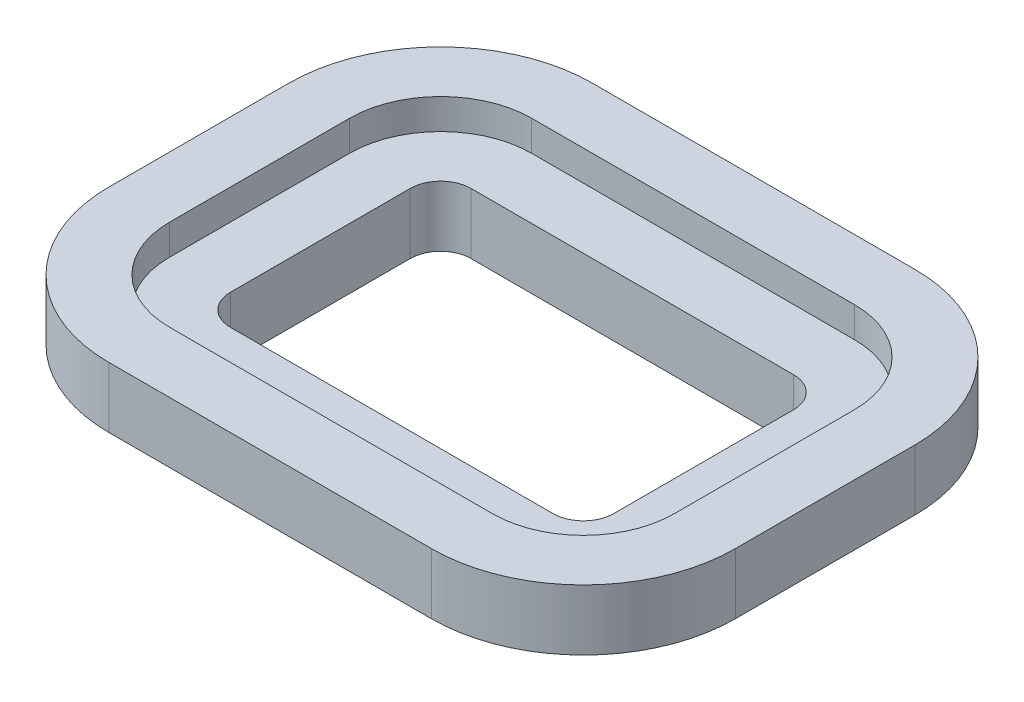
ISO-10303-21;
HEADER;
FILE_DESCRIPTION(('STEP AP214'),'2;1');
FILE_NAME('part.step','',(''),(''),'','','');
FILE_SCHEMA(('AUTOMOTIVE_DESIGN { 1 0 10303 214 1 1 1 1 }'));
ENDSEC;
DATA;
#1=APPLICATION_CONTEXT('core data for automotive mechanical design processes');
#2=APPLICATION_PROTOCOL_DEFINITION('international standard','automotive_design',2000,#1);
#3=PRODUCT_CONTEXT('',#1,'mechanical');
#4=PRODUCT('Part','Part','',(#3));
#5=PRODUCT_RELATED_PRODUCT_CATEGORY('part','',(#4));
#6=PRODUCT_DEFINITION_FORMATION('','',#4);
#7=PRODUCT_DEFINITION_CONTEXT('part definition',#1,'design');
#8=PRODUCT_DEFINITION('design','',#6,#7);
#9=PRODUCT_DEFINITION_SHAPE('','',#8);
#10=(LENGTH_UNIT() NAMED_UNIT(*) SI_UNIT(.MILLI.,.METRE.));
#11=(NAMED_UNIT(*) PLANE_ANGLE_UNIT() SI_UNIT($,.RADIAN.));
#12=(NAMED_UNIT(*) SI_UNIT($,.STERADIAN.) SOLID_ANGLE_UNIT());
#13=UNCERTAINTY_MEASURE_WITH_UNIT(LENGTH_MEASURE(1.E-05),#10,'distance_accuracy_value','');
#14=(GEOMETRIC_REPRESENTATION_CONTEXT(3) GLOBAL_UNCERTAINTY_ASSIGNED_CONTEXT((#13)) GLOBAL_UNIT_ASSIGNED_CONTEXT((#10,
#11,#12)) REPRESENTATION_CONTEXT('',''));
#15=CARTESIAN_POINT('',(0.,0.,0.));
#16=DIRECTION('',(0.,0.,1.));
#17=DIRECTION('',(1.,0.,0.));
#18=AXIS2_PLACEMENT_3D('',#15,#16,#17);
#19=CARTESIAN_POINT('',(116.208722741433,0.,-10.));
#20=DIRECTION('',(0.,-1.,0.));
#21=DIRECTION('',(0.,0.,-1.));
#22=AXIS2_PLACEMENT_3D('',#19,#20,#21);
#23=CYLINDRICAL_SURFACE('',#22,9.99999999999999);
#24=DIRECTION('',(0.,1.,0.));
#25=VECTOR('',#24,1.);
#26=CARTESIAN_POINT('',(126.208722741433,0.,-10.0000000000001));
#27=LINE('',#26,#25);
#28=CARTESIAN_POINT('',(126.208722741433,-20.,-10.0000000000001));
#29=VERTEX_POINT('',#28);
#30=CARTESIAN_POINT('',(126.208722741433,0.,-10.0000000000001));
#31=VERTEX_POINT('',#30);
#32=EDGE_CURVE('E350',#29,#31,#27,.T.);
#33=ORIENTED_EDGE('',*,*,#32,.F.);
#34=CARTESIAN_POINT('',(116.208722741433,-20.,-10.));
#35=DIRECTION('',(0.,-1.,0.));
#36=DIRECTION('',(0.,0.,-1.));
#37=AXIS2_PLACEMENT_3D('',#34,#35,#36);
#38=CIRCLE('',#37,9.99999999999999);
#39=CARTESIAN_POINT('',(116.208722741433,-20.,0.));
#40=VERTEX_POINT('',#39);
#41=EDGE_CURVE('E44',#29,#40,#38,.T.);
#42=ORIENTED_EDGE('',*,*,#41,.T.);
#43=CARTESIAN_POINT('',(116.208722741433,-20.,0.));
#44=DIRECTION('',(0.,1.,0.));
#45=VECTOR('',#44,1.);
#46=LINE('',#43,#45);
#47=CARTESIAN_POINT('',(116.208722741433,0.,0.));
#48=VERTEX_POINT('',#47);
#49=EDGE_CURVE('E279',#40,#48,#46,.T.);
#50=ORIENTED_EDGE('',*,*,#49,.T.);
#51=CARTESIAN_POINT('',(116.208722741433,0.,-10.));
#52=DIRECTION('',(0.,-1.,0.));
#53=DIRECTION('',(0.,0.,-1.));
#54=AXIS2_PLACEMENT_3D('',#51,#52,#53);
#55=CIRCLE('',#54,9.99999999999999);
#56=EDGE_CURVE('E11',#31,#48,#55,.T.);
#57=ORIENTED_EDGE('',*,*,#56,.F.);
#58=EDGE_LOOP('',(#33,#42,#50,#57));
#59=FACE_BOUND('',#58,.T.);
#60=ADVANCED_FACE('F33',(#59),#23,.F.);
#61=CARTESIAN_POINT('',(116.208722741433,0.,-10.));
#62=DIRECTION('',(0.,-1.,0.));
#63=DIRECTION('',(0.,0.,-1.));
#64=AXIS2_PLACEMENT_3D('',#61,#62,#63);
#65=CYLINDRICAL_SURFACE('',#64,30.);
#66=DIRECTION('',(0.,-1.,0.));
#67=VECTOR('',#66,1.);
#68=CARTESIAN_POINT('',(146.208722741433,-20.,-9.99999999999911));
#69=LINE('',#68,#67);
#70=CARTESIAN_POINT('',(146.208722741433,-10.,-9.99999999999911));
#71=VERTEX_POINT('',#70);
#72=CARTESIAN_POINT('',(146.208722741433,-20.,-9.99999999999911));
#73=VERTEX_POINT('',#72);
#74=EDGE_CURVE('E346',#71,#73,#69,.T.);
#75=ORIENTED_EDGE('',*,*,#74,.F.);
#76=CARTESIAN_POINT('',(116.208722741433,-10.,-10.));
#77=DIRECTION('',(0.,-1.,0.));
#78=DIRECTION('',(0.,0.,-1.));
#79=AXIS2_PLACEMENT_3D('',#76,#77,#78);
#80=CIRCLE('',#79,30.);
#81=CARTESIAN_POINT('',(116.208722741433,-10.,20.));
#82=VERTEX_POINT('',#81);
#83=EDGE_CURVE('E314',#71,#82,#80,.T.);
#84=ORIENTED_EDGE('',*,*,#83,.T.);
#85=CARTESIAN_POINT('',(116.208722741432,-10.,20.));
#86=DIRECTION('',(0.,-1.,0.));
#87=VECTOR('',#86,1.);
#88=LINE('',#85,#87);
#89=CARTESIAN_POINT('',(116.208722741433,-20.,20.));
#90=VERTEX_POINT('',#89);
#91=EDGE_CURVE('E404',#82,#90,#88,.T.);
#92=ORIENTED_EDGE('',*,*,#91,.T.);
#93=CARTESIAN_POINT('',(116.208722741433,-20.,-10.));
#94=DIRECTION('',(0.,-1.,0.));
#95=DIRECTION('',(0.,0.,-1.));
#96=AXIS2_PLACEMENT_3D('',#93,#94,#95);
#97=CIRCLE('',#96,30.);
#98=EDGE_CURVE('E322',#73,#90,#97,.T.);
#99=ORIENTED_EDGE('',*,*,#98,.F.);
#100=EDGE_LOOP('',(#75,#84,#92,#99));
#101=FACE_BOUND('',#100,.T.);
#102=ADVANCED_FACE('F300',(#101),#65,.T.);
#103=CARTESIAN_POINT('',(116.208722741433,0.,-10.));
#104=DIRECTION('',(0.,-1.,0.));
#105=DIRECTION('',(0.,0.,-1.));
#106=AXIS2_PLACEMENT_3D('',#103,#104,#105);
#107=CYLINDRICAL_SURFACE('',#106,50.);
#108=DIRECTION('',(0.,-1.,0.));
#109=VECTOR('',#108,1.);
#110=CARTESIAN_POINT('',(166.208722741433,-10.,-9.99999999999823));
#111=LINE('',#110,#109);
#112=CARTESIAN_POINT('',(166.208722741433,10.,-9.99999999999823));
#113=VERTEX_POINT('',#112);
#114=CARTESIAN_POINT('',(166.208722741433,-10.,-9.99999999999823));
#115=VERTEX_POINT('',#114);
#116=EDGE_CURVE('E338',#113,#115,#111,.T.);
#117=ORIENTED_EDGE('',*,*,#116,.F.);
#118=CARTESIAN_POINT('',(116.208722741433,10.,-10.));
#119=DIRECTION('',(0.,-1.,0.));
#120=DIRECTION('',(0.,0.,-1.));
#121=AXIS2_PLACEMENT_3D('',#118,#119,#120);
#122=CIRCLE('',#121,50.);
#123=CARTESIAN_POINT('',(116.208722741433,10.,40.));
#124=VERTEX_POINT('',#123);
#125=EDGE_CURVE('E274',#113,#124,#122,.T.);
#126=ORIENTED_EDGE('',*,*,#125,.T.);
#127=CARTESIAN_POINT('',(116.208722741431,10.,40.));
#128=DIRECTION('',(0.,-1.,0.));
#129=VECTOR('',#128,1.);
#130=LINE('',#127,#129);
#131=CARTESIAN_POINT('',(116.208722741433,-10.,40.));
#132=VERTEX_POINT('',#131);
#133=EDGE_CURVE('E266',#124,#132,#130,.T.);
#134=ORIENTED_EDGE('',*,*,#133,.T.);
#135=CARTESIAN_POINT('',(116.208722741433,-10.,-10.));
#136=DIRECTION('',(0.,-1.,0.));
#137=DIRECTION('',(0.,0.,-1.));
#138=AXIS2_PLACEMENT_3D('',#135,#136,#137);
#139=CIRCLE('',#138,50.);
#140=EDGE_CURVE('E277',#115,#132,#139,.T.);
#141=ORIENTED_EDGE('',*,*,#140,.F.);
#142=EDGE_LOOP('',(#117,#126,#134,#141));
#143=FACE_BOUND('',#142,.T.);
#144=ADVANCED_FACE('F291',(#143),#107,.T.);
#145=CARTESIAN_POINT('',(116.208722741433,0.,-10.));
#146=DIRECTION('',(0.,-1.,0.));
#147=DIRECTION('',(0.,0.,-1.));
#148=AXIS2_PLACEMENT_3D('',#145,#146,#147);
#149=CYLINDRICAL_SURFACE('',#148,30.);
#150=DIRECTION('',(0.,1.,0.));
#151=VECTOR('',#150,1.);
#152=CARTESIAN_POINT('',(146.208722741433,10.,-9.99999999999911));
#153=LINE('',#152,#151);
#154=CARTESIAN_POINT('',(146.208722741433,0.,-9.99999999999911));
#155=VERTEX_POINT('',#154);
#156=CARTESIAN_POINT('',(146.208722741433,10.,-9.99999999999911));
#157=VERTEX_POINT('',#156);
#158=EDGE_CURVE('E347',#155,#157,#153,.T.);
#159=ORIENTED_EDGE('',*,*,#158,.F.);
#160=CARTESIAN_POINT('',(116.208722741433,0.,-10.));
#161=DIRECTION('',(0.,-1.,0.));
#162=DIRECTION('',(0.,0.,-1.));
#163=AXIS2_PLACEMENT_3D('',#160,#161,#162);
#164=CIRCLE('',#163,30.);
#165=CARTESIAN_POINT('',(116.208722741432,0.,20.));
#166=VERTEX_POINT('',#165);
#167=EDGE_CURVE('E60',#155,#166,#164,.T.);
#168=ORIENTED_EDGE('',*,*,#167,.T.);
#169=CARTESIAN_POINT('',(116.208722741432,0.,20.));
#170=DIRECTION('',(0.,1.,0.));
#171=VECTOR('',#170,1.);
#172=LINE('',#169,#171);
#173=CARTESIAN_POINT('',(116.208722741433,10.,20.));
#174=VERTEX_POINT('',#173);
#175=EDGE_CURVE('E253',#166,#174,#172,.T.);
#176=ORIENTED_EDGE('',*,*,#175,.T.);
#177=CARTESIAN_POINT('',(116.208722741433,10.,-10.));
#178=DIRECTION('',(0.,-1.,0.));
#179=DIRECTION('',(0.,0.,-1.));
#180=AXIS2_PLACEMENT_3D('',#177,#178,#179);
#181=CIRCLE('',#180,30.);
#182=EDGE_CURVE('E264',#157,#174,#181,.T.);
#183=ORIENTED_EDGE('',*,*,#182,.F.);
#184=EDGE_LOOP('',(#159,#168,#176,#183));
#185=FACE_BOUND('',#184,.T.);
#186=ADVANCED_FACE('F263',(#185),#149,.F.);
#187=CARTESIAN_POINT('',(126.208722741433,0.,-69.2068535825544));
#188=DIRECTION('',(1.,0.,0.));
#189=DIRECTION('',(0.,1.,0.));
#190=AXIS2_PLACEMENT_3D('',#187,#188,#189);
#191=PLANE('',#190);
#192=DIRECTION('',(0.,1.,0.));
#193=VECTOR('',#192,1.);
#194=CARTESIAN_POINT('',(126.208722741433,0.,-69.2068535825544));
#195=LINE('',#194,#193);
#196=CARTESIAN_POINT('',(126.208722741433,-20.,-69.2068535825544));
#197=VERTEX_POINT('',#196);
#198=CARTESIAN_POINT('',(126.208722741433,0.,-69.2068535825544));
#199=VERTEX_POINT('',#198);
#200=EDGE_CURVE('E623',#197,#199,#195,.T.);
#201=ORIENTED_EDGE('',*,*,#200,.F.);
#202=DIRECTION('',(0.,0.,1.));
#203=VECTOR('',#202,1.);
#204=CARTESIAN_POINT('',(126.208722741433,-20.,-69.2068535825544));
#205=LINE('',#204,#203);
#206=EDGE_CURVE('E370',#197,#29,#205,.T.);
#207=ORIENTED_EDGE('',*,*,#206,.T.);
#208=ORIENTED_EDGE('',*,*,#32,.T.);
#209=DIRECTION('',(0.,0.,1.));
#210=VECTOR('',#209,1.);
#211=CARTESIAN_POINT('',(126.208722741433,0.,-69.2068535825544));
#212=LINE('',#211,#210);
#213=EDGE_CURVE('E267',#199,#31,#212,.T.);
#214=ORIENTED_EDGE('',*,*,#213,.F.);
#215=EDGE_LOOP('',(#201,#207,#208,#214));
#216=FACE_BOUND('',#215,.T.);
#217=ADVANCED_FACE('F655',(#216),#191,.F.);
#218=CARTESIAN_POINT('',(146.208722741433,-20.,-69.2068535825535));
#219=DIRECTION('',(-1.,0.,0.));
#220=DIRECTION('',(0.,0.,1.));
#221=AXIS2_PLACEMENT_3D('',#218,#219,#220);
#222=PLANE('',#221);
#223=DIRECTION('',(0.,-1.,0.));
#224=VECTOR('',#223,1.);
#225=CARTESIAN_POINT('',(146.208722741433,-20.,-69.2068535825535));
#226=LINE('',#225,#224);
#227=CARTESIAN_POINT('',(146.208722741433,-10.,-69.2068535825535));
#228=VERTEX_POINT('',#227);
#229=CARTESIAN_POINT('',(146.208722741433,-20.,-69.2068535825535));
#230=VERTEX_POINT('',#229);
#231=EDGE_CURVE('E409',#228,#230,#226,.T.);
#232=ORIENTED_EDGE('',*,*,#231,.F.);
#233=DIRECTION('',(0.,0.,1.));
#234=VECTOR('',#233,1.);
#235=CARTESIAN_POINT('',(146.208722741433,-10.,-69.2068535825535));
#236=LINE('',#235,#234);
#237=EDGE_CURVE('E364',#228,#71,#236,.T.);
#238=ORIENTED_EDGE('',*,*,#237,.T.);
#239=ORIENTED_EDGE('',*,*,#74,.T.);
#240=DIRECTION('',(0.,0.,1.));
#241=VECTOR('',#240,1.);
#242=CARTESIAN_POINT('',(146.208722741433,-20.,-69.2068535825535));
#243=LINE('',#242,#241);
#244=EDGE_CURVE('E367',#230,#73,#243,.T.);
#245=ORIENTED_EDGE('',*,*,#244,.F.);
#246=EDGE_LOOP('',(#232,#238,#239,#245));
#247=FACE_BOUND('',#246,.T.);
#248=ADVANCED_FACE('F407',(#247),#222,.F.);
#249=CARTESIAN_POINT('',(166.208722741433,-10.,-69.2068535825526));
#250=DIRECTION('',(-1.,0.,0.));
#251=DIRECTION('',(0.,0.,1.));
#252=AXIS2_PLACEMENT_3D('',#249,#250,#251);
#253=PLANE('',#252);
#254=DIRECTION('',(0.,-1.,0.));
#255=VECTOR('',#254,1.);
#256=CARTESIAN_POINT('',(166.208722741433,-10.,-69.2068535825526));
#257=LINE('',#256,#255);
#258=CARTESIAN_POINT('',(166.208722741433,10.,-69.2068535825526));
#259=VERTEX_POINT('',#258);
#260=CARTESIAN_POINT('',(166.208722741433,-10.,-69.2068535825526));
#261=VERTEX_POINT('',#260);
#262=EDGE_CURVE('E620',#259,#261,#257,.T.);
#263=ORIENTED_EDGE('',*,*,#262,.F.);
#264=DIRECTION('',(0.,0.,1.));
#265=VECTOR('',#264,1.);
#266=CARTESIAN_POINT('',(166.208722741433,10.,-69.2068535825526));
#267=LINE('',#266,#265);
#268=EDGE_CURVE('E345',#259,#113,#267,.T.);
#269=ORIENTED_EDGE('',*,*,#268,.T.);
#270=ORIENTED_EDGE('',*,*,#116,.T.);
#271=DIRECTION('',(0.,0.,1.));
#272=VECTOR('',#271,1.);
#273=CARTESIAN_POINT('',(166.208722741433,-10.,-69.2068535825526));
#274=LINE('',#273,#272);
#275=EDGE_CURVE('E335',#261,#115,#274,.T.);
#276=ORIENTED_EDGE('',*,*,#275,.F.);
#277=EDGE_LOOP('',(#263,#269,#270,#276));
#278=FACE_BOUND('',#277,.T.);
#279=ADVANCED_FACE('F343',(#278),#253,.F.);
#280=CARTESIAN_POINT('',(146.208722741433,10.,-69.2068535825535));
#281=DIRECTION('',(1.,0.,0.));
#282=DIRECTION('',(0.,0.,-1.));
#283=AXIS2_PLACEMENT_3D('',#280,#281,#282);
#284=PLANE('',#283);
#285=DIRECTION('',(0.,1.,0.));
#286=VECTOR('',#285,1.);
#287=CARTESIAN_POINT('',(146.208722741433,10.,-69.2068535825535));
#288=LINE('',#287,#286);
#289=CARTESIAN_POINT('',(146.208722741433,0.,-69.2068535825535));
#290=VERTEX_POINT('',#289);
#291=CARTESIAN_POINT('',(146.208722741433,10.,-69.2068535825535));
#292=VERTEX_POINT('',#291);
#293=EDGE_CURVE('E617',#290,#292,#288,.T.);
#294=ORIENTED_EDGE('',*,*,#293,.F.);
#295=DIRECTION('',(0.,0.,1.));
#296=VECTOR('',#295,1.);
#297=CARTESIAN_POINT('',(146.208722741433,0.,-69.2068535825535));
#298=LINE('',#297,#296);
#299=EDGE_CURVE('E358',#290,#155,#298,.T.);
#300=ORIENTED_EDGE('',*,*,#299,.T.);
#301=ORIENTED_EDGE('',*,*,#158,.T.);
#302=DIRECTION('',(0.,0.,1.));
#303=VECTOR('',#302,1.);
#304=CARTESIAN_POINT('',(146.208722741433,10.,-69.2068535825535));
#305=LINE('',#304,#303);
#306=EDGE_CURVE('E273',#292,#157,#305,.T.);
#307=ORIENTED_EDGE('',*,*,#306,.F.);
#308=EDGE_LOOP('',(#294,#300,#301,#307));
#309=FACE_BOUND('',#308,.T.);
#310=ADVANCED_FACE('F715',(#309),#284,.F.);
#311=CARTESIAN_POINT('',(116.208722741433,0.,-69.2068535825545));
#312=DIRECTION('',(0.,-1.,0.));
#313=DIRECTION('',(0.,0.,-1.));
#314=AXIS2_PLACEMENT_3D('',#311,#312,#313);
#315=CYLINDRICAL_SURFACE('',#314,10.);
#316=DIRECTION('',(0.,1.,0.));
#317=VECTOR('',#316,1.);
#318=CARTESIAN_POINT('',(116.208722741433,0.,-79.2068535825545));
#319=LINE('',#318,#317);
#320=CARTESIAN_POINT('',(116.208722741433,-20.,-79.2068535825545));
#321=VERTEX_POINT('',#320);
#322=CARTESIAN_POINT('',(116.208722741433,0.,-79.2068535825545));
#323=VERTEX_POINT('',#322);
#324=EDGE_CURVE('E590',#321,#323,#319,.T.);
#325=ORIENTED_EDGE('',*,*,#324,.F.);
#326=CARTESIAN_POINT('',(116.208722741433,-20.,-69.2068535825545));
#327=DIRECTION('',(0.,-1.,0.));
#328=DIRECTION('',(0.,0.,-1.));
#329=AXIS2_PLACEMENT_3D('',#326,#327,#328);
#330=CIRCLE('',#329,9.99999999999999);
#331=EDGE_CURVE('E639',#321,#197,#330,.T.);
#332=ORIENTED_EDGE('',*,*,#331,.T.);
#333=ORIENTED_EDGE('',*,*,#200,.T.);
#334=CARTESIAN_POINT('',(116.208722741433,0.,-69.2068535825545));
#335=DIRECTION('',(0.,-1.,0.));
#336=DIRECTION('',(0.,0.,-1.));
#337=AXIS2_PLACEMENT_3D('',#334,#335,#336);
#338=CIRCLE('',#337,10.);
#339=EDGE_CURVE('E352',#323,#199,#338,.T.);
#340=ORIENTED_EDGE('',*,*,#339,.F.);
#341=EDGE_LOOP('',(#325,#332,#333,#340));
#342=FACE_BOUND('',#341,.T.);
#343=ADVANCED_FACE('F646',(#342),#315,.F.);
#344=CARTESIAN_POINT('',(116.208722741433,0.,-69.2068535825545));
#345=DIRECTION('',(0.,-1.,0.));
#346=DIRECTION('',(0.,0.,-1.));
#347=AXIS2_PLACEMENT_3D('',#344,#345,#346);
#348=CYLINDRICAL_SURFACE('',#347,30.);
#349=DIRECTION('',(0.,-1.,0.));
#350=VECTOR('',#349,1.);
#351=CARTESIAN_POINT('',(116.208722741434,-20.,-99.2068535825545));
#352=LINE('',#351,#350);
#353=CARTESIAN_POINT('',(116.208722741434,-10.,-99.2068535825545));
#354=VERTEX_POINT('',#353);
#355=CARTESIAN_POINT('',(116.208722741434,-20.,-99.2068535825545));
#356=VERTEX_POINT('',#355);
#357=EDGE_CURVE('E587',#354,#356,#352,.T.);
#358=ORIENTED_EDGE('',*,*,#357,.F.);
#359=CARTESIAN_POINT('',(116.208722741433,-10.,-69.2068535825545));
#360=DIRECTION('',(0.,-1.,0.));
#361=DIRECTION('',(0.,0.,-1.));
#362=AXIS2_PLACEMENT_3D('',#359,#360,#361);
#363=CIRCLE('',#362,30.);
#364=EDGE_CURVE('E412',#354,#228,#363,.T.);
#365=ORIENTED_EDGE('',*,*,#364,.T.);
#366=ORIENTED_EDGE('',*,*,#231,.T.);
#367=CARTESIAN_POINT('',(116.208722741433,-20.,-69.2068535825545));
#368=DIRECTION('',(0.,-1.,0.));
#369=DIRECTION('',(0.,0.,-1.));
#370=AXIS2_PLACEMENT_3D('',#367,#368,#369);
#371=CIRCLE('',#370,30.);
#372=EDGE_CURVE('E637',#356,#230,#371,.T.);
#373=ORIENTED_EDGE('',*,*,#372,.F.);
#374=EDGE_LOOP('',(#358,#365,#366,#373));
#375=FACE_BOUND('',#374,.T.);
#376=ADVANCED_FACE('F729',(#375),#348,.T.);
#377=CARTESIAN_POINT('',(116.208722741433,0.,-69.2068535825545));
#378=DIRECTION('',(0.,-1.,0.));
#379=DIRECTION('',(0.,0.,-1.));
#380=AXIS2_PLACEMENT_3D('',#377,#378,#379);
#381=CYLINDRICAL_SURFACE('',#380,50.);
#382=DIRECTION('',(0.,-1.,0.));
#383=VECTOR('',#382,1.);
#384=CARTESIAN_POINT('',(116.208722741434,-10.,-119.206853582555));
#385=LINE('',#384,#383);
#386=CARTESIAN_POINT('',(116.208722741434,10.,-119.206853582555));
#387=VERTEX_POINT('',#386);
#388=CARTESIAN_POINT('',(116.208722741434,-10.,-119.206853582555));
#389=VERTEX_POINT('',#388);
#390=EDGE_CURVE('E584',#387,#389,#385,.T.);
#391=ORIENTED_EDGE('',*,*,#390,.F.);
#392=CARTESIAN_POINT('',(116.208722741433,10.,-69.2068535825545));
#393=DIRECTION('',(0.,-1.,0.));
#394=DIRECTION('',(0.,0.,-1.));
#395=AXIS2_PLACEMENT_3D('',#392,#393,#394);
#396=CIRCLE('',#395,50.);
#397=EDGE_CURVE('E631',#387,#259,#396,.T.);
#398=ORIENTED_EDGE('',*,*,#397,.T.);
#399=ORIENTED_EDGE('',*,*,#262,.T.);
#400=CARTESIAN_POINT('',(116.208722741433,-10.,-69.2068535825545));
#401=DIRECTION('',(0.,-1.,0.));
#402=DIRECTION('',(0.,0.,-1.));
#403=AXIS2_PLACEMENT_3D('',#400,#401,#402);
#404=CIRCLE('',#403,50.);
#405=EDGE_CURVE('E634',#389,#261,#404,.T.);
#406=ORIENTED_EDGE('',*,*,#405,.F.);
#407=EDGE_LOOP('',(#391,#398,#399,#406));
#408=FACE_BOUND('',#407,.T.);
#409=ADVANCED_FACE('F736',(#408),#381,.T.);
#410=CARTESIAN_POINT('',(116.208722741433,0.,-69.2068535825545));
#411=DIRECTION('',(0.,-1.,0.));
#412=DIRECTION('',(0.,0.,-1.));
#413=AXIS2_PLACEMENT_3D('',#410,#411,#412);
#414=CYLINDRICAL_SURFACE('',#413,30.);
#415=DIRECTION('',(0.,1.,0.));
#416=VECTOR('',#415,1.);
#417=CARTESIAN_POINT('',(116.208722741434,10.,-99.2068535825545));
#418=LINE('',#417,#416);
#419=CARTESIAN_POINT('',(116.208722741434,0.,-99.2068535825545));
#420=VERTEX_POINT('',#419);
#421=CARTESIAN_POINT('',(116.208722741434,10.,-99.2068535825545));
#422=VERTEX_POINT('',#421);
#423=EDGE_CURVE('E581',#420,#422,#418,.T.);
#424=ORIENTED_EDGE('',*,*,#423,.F.);
#425=CARTESIAN_POINT('',(116.208722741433,0.,-69.2068535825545));
#426=DIRECTION('',(0.,-1.,0.));
#427=DIRECTION('',(0.,0.,-1.));
#428=AXIS2_PLACEMENT_3D('',#425,#426,#427);
#429=CIRCLE('',#428,30.);
#430=EDGE_CURVE('E626',#420,#290,#429,.T.);
#431=ORIENTED_EDGE('',*,*,#430,.T.);
#432=ORIENTED_EDGE('',*,*,#293,.T.);
#433=CARTESIAN_POINT('',(116.208722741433,10.,-69.2068535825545));
#434=DIRECTION('',(0.,-1.,0.));
#435=DIRECTION('',(0.,0.,-1.));
#436=AXIS2_PLACEMENT_3D('',#433,#434,#435);
#437=CIRCLE('',#436,30.);
#438=EDGE_CURVE('E629',#422,#292,#437,.T.);
#439=ORIENTED_EDGE('',*,*,#438,.F.);
#440=EDGE_LOOP('',(#424,#431,#432,#439));
#441=FACE_BOUND('',#440,.T.);
#442=ADVANCED_FACE('F744',(#441),#414,.F.);
#443=CARTESIAN_POINT('',(10.0000000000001,0.,-79.2068535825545));
#444=DIRECTION('',(0.,0.,-1.));
#445=DIRECTION('',(0.,1.,0.));
#446=AXIS2_PLACEMENT_3D('',#443,#444,#445);
#447=PLANE('',#446);
#448=DIRECTION('',(0.,1.,0.));
#449=VECTOR('',#448,1.);
#450=CARTESIAN_POINT('',(10.0000000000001,0.,-79.2068535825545));
#451=LINE('',#450,#449);
#452=CARTESIAN_POINT('',(10.0000000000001,-20.,-79.2068535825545));
#453=VERTEX_POINT('',#452);
#454=CARTESIAN_POINT('',(10.0000000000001,0.,-79.2068535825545));
#455=VERTEX_POINT('',#454);
#456=EDGE_CURVE('E554',#453,#455,#451,.T.);
#457=ORIENTED_EDGE('',*,*,#456,.F.);
#458=DIRECTION('',(1.,0.,0.));
#459=VECTOR('',#458,1.);
#460=CARTESIAN_POINT('',(10.0000000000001,-20.,-79.2068535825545));
#461=LINE('',#460,#459);
#462=EDGE_CURVE('E611',#453,#321,#461,.T.);
#463=ORIENTED_EDGE('',*,*,#462,.T.);
#464=ORIENTED_EDGE('',*,*,#324,.T.);
#465=DIRECTION('',(1.,0.,0.));
#466=VECTOR('',#465,1.);
#467=CARTESIAN_POINT('',(10.0000000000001,0.,-79.2068535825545));
#468=LINE('',#467,#466);
#469=EDGE_CURVE('E614',#455,#323,#468,.T.);
#470=ORIENTED_EDGE('',*,*,#469,.F.);
#471=EDGE_LOOP('',(#457,#463,#464,#470));
#472=FACE_BOUND('',#471,.T.);
#473=ADVANCED_FACE('F650',(#472),#447,.F.);
#474=CARTESIAN_POINT('',(10.0000000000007,-20.,-99.2068535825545));
#475=DIRECTION('',(0.,0.,1.));
#476=DIRECTION('',(1.,0.,0.));
#477=AXIS2_PLACEMENT_3D('',#474,#475,#476);
#478=PLANE('',#477);
#479=DIRECTION('',(0.,-1.,0.));
#480=VECTOR('',#479,1.);
#481=CARTESIAN_POINT('',(10.0000000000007,-20.,-99.2068535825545));
#482=LINE('',#481,#480);
#483=CARTESIAN_POINT('',(10.0000000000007,-10.,-99.2068535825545));
#484=VERTEX_POINT('',#483);
#485=CARTESIAN_POINT('',(10.0000000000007,-20.,-99.2068535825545));
#486=VERTEX_POINT('',#485);
#487=EDGE_CURVE('E551',#484,#486,#482,.T.);
#488=ORIENTED_EDGE('',*,*,#487,.F.);
#489=DIRECTION('',(1.,0.,0.));
#490=VECTOR('',#489,1.);
#491=CARTESIAN_POINT('',(10.0000000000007,-10.,-99.2068535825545));
#492=LINE('',#491,#490);
#493=EDGE_CURVE('E605',#484,#354,#492,.T.);
#494=ORIENTED_EDGE('',*,*,#493,.T.);
#495=ORIENTED_EDGE('',*,*,#357,.T.);
#496=DIRECTION('',(1.,0.,0.));
#497=VECTOR('',#496,1.);
#498=CARTESIAN_POINT('',(10.0000000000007,-20.,-99.2068535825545));
#499=LINE('',#498,#497);
#500=EDGE_CURVE('E608',#486,#356,#499,.T.);
#501=ORIENTED_EDGE('',*,*,#500,.F.);
#502=EDGE_LOOP('',(#488,#494,#495,#501));
#503=FACE_BOUND('',#502,.T.);
#504=ADVANCED_FACE('F759',(#503),#478,.F.);
#505=CARTESIAN_POINT('',(10.0000000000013,-10.,-119.206853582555));
#506=DIRECTION('',(0.,0.,1.));
#507=DIRECTION('',(1.,0.,0.));
#508=AXIS2_PLACEMENT_3D('',#505,#506,#507);
#509=PLANE('',#508);
#510=DIRECTION('',(0.,-1.,0.));
#511=VECTOR('',#510,1.);
#512=CARTESIAN_POINT('',(10.0000000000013,-10.,-119.206853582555));
#513=LINE('',#512,#511);
#514=CARTESIAN_POINT('',(10.0000000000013,10.,-119.206853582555));
#515=VERTEX_POINT('',#514);
#516=CARTESIAN_POINT('',(10.0000000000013,-10.,-119.206853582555));
#517=VERTEX_POINT('',#516);
#518=EDGE_CURVE('E548',#515,#517,#513,.T.);
#519=ORIENTED_EDGE('',*,*,#518,.F.);
#520=DIRECTION('',(1.,0.,0.));
#521=VECTOR('',#520,1.);
#522=CARTESIAN_POINT('',(10.0000000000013,10.,-119.206853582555));
#523=LINE('',#522,#521);
#524=EDGE_CURVE('E599',#515,#387,#523,.T.);
#525=ORIENTED_EDGE('',*,*,#524,.T.);
#526=ORIENTED_EDGE('',*,*,#390,.T.);
#527=DIRECTION('',(1.,0.,0.));
#528=VECTOR('',#527,1.);
#529=CARTESIAN_POINT('',(10.0000000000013,-10.,-119.206853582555));
#530=LINE('',#529,#528);
#531=EDGE_CURVE('E602',#517,#389,#530,.T.);
#532=ORIENTED_EDGE('',*,*,#531,.F.);
#533=EDGE_LOOP('',(#519,#525,#526,#532));
#534=FACE_BOUND('',#533,.T.);
#535=ADVANCED_FACE('F679',(#534),#509,.F.);
#536=CARTESIAN_POINT('',(10.0000000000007,10.,-99.2068535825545));
#537=DIRECTION('',(0.,0.,-1.));
#538=DIRECTION('',(-1.,0.,0.));
#539=AXIS2_PLACEMENT_3D('',#536,#537,#538);
#540=PLANE('',#539);
#541=DIRECTION('',(0.,1.,0.));
#542=VECTOR('',#541,1.);
#543=CARTESIAN_POINT('',(10.0000000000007,10.,-99.2068535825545));
#544=LINE('',#543,#542);
#545=CARTESIAN_POINT('',(10.0000000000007,0.,-99.2068535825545));
#546=VERTEX_POINT('',#545);
#547=CARTESIAN_POINT('',(10.0000000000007,10.,-99.2068535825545));
#548=VERTEX_POINT('',#547);
#549=EDGE_CURVE('E545',#546,#548,#544,.T.);
#550=ORIENTED_EDGE('',*,*,#549,.F.);
#551=DIRECTION('',(1.,0.,0.));
#552=VECTOR('',#551,1.);
#553=CARTESIAN_POINT('',(10.0000000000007,0.,-99.2068535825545));
#554=LINE('',#553,#552);
#555=EDGE_CURVE('E593',#546,#420,#554,.T.);
#556=ORIENTED_EDGE('',*,*,#555,.T.);
#557=ORIENTED_EDGE('',*,*,#423,.T.);
#558=DIRECTION('',(1.,0.,0.));
#559=VECTOR('',#558,1.);
#560=CARTESIAN_POINT('',(10.0000000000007,10.,-99.2068535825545));
#561=LINE('',#560,#559);
#562=EDGE_CURVE('E596',#548,#422,#561,.T.);
#563=ORIENTED_EDGE('',*,*,#562,.F.);
#564=EDGE_LOOP('',(#550,#556,#557,#563));
#565=FACE_BOUND('',#564,.T.);
#566=ADVANCED_FACE('F670',(#565),#540,.F.);
#567=CARTESIAN_POINT('',(10.,0.,-69.2068535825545));
#568=DIRECTION('',(0.,-1.,0.));
#569=DIRECTION('',(0.,0.,-1.));
#570=AXIS2_PLACEMENT_3D('',#567,#568,#569);
#571=CYLINDRICAL_SURFACE('',#570,9.99999999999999);
#572=DIRECTION('',(0.,1.,0.));
#573=VECTOR('',#572,1.);
#574=CARTESIAN_POINT('',(0.,0.,-69.2068535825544));
#575=LINE('',#574,#573);
#576=CARTESIAN_POINT('',(0.,-20.,-69.2068535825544));
#577=VERTEX_POINT('',#576);
#578=CARTESIAN_POINT('',(0.,0.,-69.2068535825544));
#579=VERTEX_POINT('',#578);
#580=EDGE_CURVE('E518',#577,#579,#575,.T.);
#581=ORIENTED_EDGE('',*,*,#580,.F.);
#582=CARTESIAN_POINT('',(10.,-20.,-69.2068535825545));
#583=DIRECTION('',(0.,-1.,0.));
#584=DIRECTION('',(0.,0.,-1.));
#585=AXIS2_PLACEMENT_3D('',#582,#583,#584);
#586=CIRCLE('',#585,9.99999999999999);
#587=EDGE_CURVE('E575',#577,#453,#586,.T.);
#588=ORIENTED_EDGE('',*,*,#587,.T.);
#589=ORIENTED_EDGE('',*,*,#456,.T.);
#590=CARTESIAN_POINT('',(10.,0.,-69.2068535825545));
#591=DIRECTION('',(0.,-1.,0.));
#592=DIRECTION('',(0.,0.,-1.));
#593=AXIS2_PLACEMENT_3D('',#590,#591,#592);
#594=CIRCLE('',#593,10.);
#595=EDGE_CURVE('E578',#579,#455,#594,.T.);
#596=ORIENTED_EDGE('',*,*,#595,.F.);
#597=EDGE_LOOP('',(#581,#588,#589,#596));
#598=FACE_BOUND('',#597,.T.);
#599=ADVANCED_FACE('F667',(#598),#571,.F.);
#600=CARTESIAN_POINT('',(10.,0.,-69.2068535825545));
#601=DIRECTION('',(0.,-1.,0.));
#602=DIRECTION('',(0.,0.,-1.));
#603=AXIS2_PLACEMENT_3D('',#600,#601,#602);
#604=CYLINDRICAL_SURFACE('',#603,30.);
#605=DIRECTION('',(0.,-1.,0.));
#606=VECTOR('',#605,1.);
#607=CARTESIAN_POINT('',(-20.,-20.,-69.2068535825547));
#608=LINE('',#607,#606);
#609=CARTESIAN_POINT('',(-20.,-10.,-69.2068535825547));
#610=VERTEX_POINT('',#609);
#611=CARTESIAN_POINT('',(-20.,-20.,-69.2068535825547));
#612=VERTEX_POINT('',#611);
#613=EDGE_CURVE('E515',#610,#612,#608,.T.);
#614=ORIENTED_EDGE('',*,*,#613,.F.);
#615=CARTESIAN_POINT('',(10.,-10.,-69.2068535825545));
#616=DIRECTION('',(0.,-1.,0.));
#617=DIRECTION('',(0.,0.,-1.));
#618=AXIS2_PLACEMENT_3D('',#615,#616,#617);
#619=CIRCLE('',#618,30.);
#620=EDGE_CURVE('E569',#610,#484,#619,.T.);
#621=ORIENTED_EDGE('',*,*,#620,.T.);
#622=ORIENTED_EDGE('',*,*,#487,.T.);
#623=CARTESIAN_POINT('',(10.,-20.,-69.2068535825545));
#624=DIRECTION('',(0.,-1.,0.));
#625=DIRECTION('',(0.,0.,-1.));
#626=AXIS2_PLACEMENT_3D('',#623,#624,#625);
#627=CIRCLE('',#626,30.);
#628=EDGE_CURVE('E572',#612,#486,#627,.T.);
#629=ORIENTED_EDGE('',*,*,#628,.F.);
#630=EDGE_LOOP('',(#614,#621,#622,#629));
#631=FACE_BOUND('',#630,.T.);
#632=ADVANCED_FACE('F669',(#631),#604,.T.);
#633=CARTESIAN_POINT('',(10.,0.,-69.2068535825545));
#634=DIRECTION('',(0.,-1.,0.));
#635=DIRECTION('',(0.,0.,-1.));
#636=AXIS2_PLACEMENT_3D('',#633,#634,#635);
#637=CYLINDRICAL_SURFACE('',#636,50.);
#638=DIRECTION('',(0.,-1.,0.));
#639=VECTOR('',#638,1.);
#640=CARTESIAN_POINT('',(-40.,-10.,-69.206853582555));
#641=LINE('',#640,#639);
#642=CARTESIAN_POINT('',(-40.,10.,-69.206853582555));
#643=VERTEX_POINT('',#642);
#644=CARTESIAN_POINT('',(-40.,-10.,-69.206853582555));
#645=VERTEX_POINT('',#644);
#646=EDGE_CURVE('E512',#643,#645,#641,.T.);
#647=ORIENTED_EDGE('',*,*,#646,.F.);
#648=CARTESIAN_POINT('',(10.,10.,-69.2068535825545));
#649=DIRECTION('',(0.,-1.,0.));
#650=DIRECTION('',(0.,0.,-1.));
#651=AXIS2_PLACEMENT_3D('',#648,#649,#650);
#652=CIRCLE('',#651,50.);
#653=EDGE_CURVE('E563',#643,#515,#652,.T.);
#654=ORIENTED_EDGE('',*,*,#653,.T.);
#655=ORIENTED_EDGE('',*,*,#518,.T.);
#656=CARTESIAN_POINT('',(10.,-10.,-69.2068535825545));
#657=DIRECTION('',(0.,-1.,0.));
#658=DIRECTION('',(0.,0.,-1.));
#659=AXIS2_PLACEMENT_3D('',#656,#657,#658);
#660=CIRCLE('',#659,50.);
#661=EDGE_CURVE('E566',#645,#517,#660,.T.);
#662=ORIENTED_EDGE('',*,*,#661,.F.);
#663=EDGE_LOOP('',(#647,#654,#655,#662));
#664=FACE_BOUND('',#663,.T.);
#665=ADVANCED_FACE('F676',(#664),#637,.T.);
#666=CARTESIAN_POINT('',(10.,0.,-69.2068535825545));
#667=DIRECTION('',(0.,-1.,0.));
#668=DIRECTION('',(0.,0.,-1.));
#669=AXIS2_PLACEMENT_3D('',#666,#667,#668);
#670=CYLINDRICAL_SURFACE('',#669,30.);
#671=DIRECTION('',(0.,1.,0.));
#672=VECTOR('',#671,1.);
#673=CARTESIAN_POINT('',(-20.,10.,-69.2068535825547));
#674=LINE('',#673,#672);
#675=CARTESIAN_POINT('',(-20.,0.,-69.2068535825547));
#676=VERTEX_POINT('',#675);
#677=CARTESIAN_POINT('',(-20.,10.,-69.2068535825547));
#678=VERTEX_POINT('',#677);
#679=EDGE_CURVE('E509',#676,#678,#674,.T.);
#680=ORIENTED_EDGE('',*,*,#679,.F.);
#681=CARTESIAN_POINT('',(10.,0.,-69.2068535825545));
#682=DIRECTION('',(0.,-1.,0.));
#683=DIRECTION('',(0.,0.,-1.));
#684=AXIS2_PLACEMENT_3D('',#681,#682,#683);
#685=CIRCLE('',#684,30.);
#686=EDGE_CURVE('E557',#676,#546,#685,.T.);
#687=ORIENTED_EDGE('',*,*,#686,.T.);
#688=ORIENTED_EDGE('',*,*,#549,.T.);
#689=CARTESIAN_POINT('',(10.,10.,-69.2068535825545));
#690=DIRECTION('',(0.,-1.,0.));
#691=DIRECTION('',(0.,0.,-1.));
#692=AXIS2_PLACEMENT_3D('',#689,#690,#691);
#693=CIRCLE('',#692,30.);
#694=EDGE_CURVE('E560',#678,#548,#693,.T.);
#695=ORIENTED_EDGE('',*,*,#694,.F.);
#696=EDGE_LOOP('',(#680,#687,#688,#695));
#697=FACE_BOUND('',#696,.T.);
#698=ADVANCED_FACE('F797',(#697),#670,.F.);
#699=CARTESIAN_POINT('',(0.,0.,-10.0000000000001));
#700=DIRECTION('',(-1.,0.,0.));
#701=DIRECTION('',(0.,-1.,0.));
#702=AXIS2_PLACEMENT_3D('',#699,#700,#701);
#703=PLANE('',#702);
#704=DIRECTION('',(0.,1.,0.));
#705=VECTOR('',#704,1.);
#706=CARTESIAN_POINT('',(0.,0.,-10.0000000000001));
#707=LINE('',#706,#705);
#708=CARTESIAN_POINT('',(0.,-20.,-10.0000000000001));
#709=VERTEX_POINT('',#708);
#710=CARTESIAN_POINT('',(0.,0.,-10.0000000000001));
#711=VERTEX_POINT('',#710);
#712=EDGE_CURVE('E488',#709,#711,#707,.T.);
#713=ORIENTED_EDGE('',*,*,#712,.F.);
#714=DIRECTION('',(0.,0.,-1.));
#715=VECTOR('',#714,1.);
#716=CARTESIAN_POINT('',(0.,-20.,-10.0000000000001));
#717=LINE('',#716,#715);
#718=EDGE_CURVE('E539',#709,#577,#717,.T.);
#719=ORIENTED_EDGE('',*,*,#718,.T.);
#720=ORIENTED_EDGE('',*,*,#580,.T.);
#721=DIRECTION('',(0.,0.,-1.));
#722=VECTOR('',#721,1.);
#723=CARTESIAN_POINT('',(0.,0.,-10.0000000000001));
#724=LINE('',#723,#722);
#725=EDGE_CURVE('E542',#711,#579,#724,.T.);
#726=ORIENTED_EDGE('',*,*,#725,.F.);
#727=EDGE_LOOP('',(#713,#719,#720,#726));
#728=FACE_BOUND('',#727,.T.);
#729=ADVANCED_FACE('F665',(#728),#703,.F.);
#730=CARTESIAN_POINT('',(-20.,-20.,-10.0000000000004));
#731=DIRECTION('',(1.,0.,0.));
#732=DIRECTION('',(0.,0.,-1.));
#733=AXIS2_PLACEMENT_3D('',#730,#731,#732);
#734=PLANE('',#733);
#735=DIRECTION('',(0.,-1.,0.));
#736=VECTOR('',#735,1.);
#737=CARTESIAN_POINT('',(-20.,-20.,-10.0000000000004));
#738=LINE('',#737,#736);
#739=CARTESIAN_POINT('',(-20.,-10.,-10.0000000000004));
#740=VERTEX_POINT('',#739);
#741=CARTESIAN_POINT('',(-20.,-20.,-10.0000000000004));
#742=VERTEX_POINT('',#741);
#743=EDGE_CURVE('E485',#740,#742,#738,.T.);
#744=ORIENTED_EDGE('',*,*,#743,.F.);
#745=DIRECTION('',(0.,0.,-1.));
#746=VECTOR('',#745,1.);
#747=CARTESIAN_POINT('',(-20.,-10.,-10.0000000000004));
#748=LINE('',#747,#746);
#749=EDGE_CURVE('E533',#740,#610,#748,.T.);
#750=ORIENTED_EDGE('',*,*,#749,.T.);
#751=ORIENTED_EDGE('',*,*,#613,.T.);
#752=DIRECTION('',(0.,0.,-1.));
#753=VECTOR('',#752,1.);
#754=CARTESIAN_POINT('',(-20.,-20.,-10.0000000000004));
#755=LINE('',#754,#753);
#756=EDGE_CURVE('E536',#742,#612,#755,.T.);
#757=ORIENTED_EDGE('',*,*,#756,.F.);
#758=EDGE_LOOP('',(#744,#750,#751,#757));
#759=FACE_BOUND('',#758,.T.);
#760=ADVANCED_FACE('F816',(#759),#734,.F.);
#761=CARTESIAN_POINT('',(-40.,-10.,-10.0000000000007));
#762=DIRECTION('',(1.,0.,0.));
#763=DIRECTION('',(0.,0.,-1.));
#764=AXIS2_PLACEMENT_3D('',#761,#762,#763);
#765=PLANE('',#764);
#766=DIRECTION('',(0.,-1.,0.));
#767=VECTOR('',#766,1.);
#768=CARTESIAN_POINT('',(-40.,-10.,-10.0000000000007));
#769=LINE('',#768,#767);
#770=CARTESIAN_POINT('',(-40.,10.,-10.0000000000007));
#771=VERTEX_POINT('',#770);
#772=CARTESIAN_POINT('',(-40.,-10.,-10.0000000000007));
#773=VERTEX_POINT('',#772);
#774=EDGE_CURVE('E482',#771,#773,#769,.T.);
#775=ORIENTED_EDGE('',*,*,#774,.F.);
#776=DIRECTION('',(0.,0.,-1.));
#777=VECTOR('',#776,1.);
#778=CARTESIAN_POINT('',(-40.,10.,-10.0000000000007));
#779=LINE('',#778,#777);
#780=EDGE_CURVE('E527',#771,#643,#779,.T.);
#781=ORIENTED_EDGE('',*,*,#780,.T.);
#782=ORIENTED_EDGE('',*,*,#646,.T.);
#783=DIRECTION('',(0.,0.,-1.));
#784=VECTOR('',#783,1.);
#785=CARTESIAN_POINT('',(-40.,-10.,-10.0000000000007));
#786=LINE('',#785,#784);
#787=EDGE_CURVE('E530',#773,#645,#786,.T.);
#788=ORIENTED_EDGE('',*,*,#787,.F.);
#789=EDGE_LOOP('',(#775,#781,#782,#788));
#790=FACE_BOUND('',#789,.T.);
#791=ADVANCED_FACE('F825',(#790),#765,.F.);
#792=CARTESIAN_POINT('',(-20.,10.,-10.0000000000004));
#793=DIRECTION('',(-1.,0.,0.));
#794=DIRECTION('',(0.,0.,1.));
#795=AXIS2_PLACEMENT_3D('',#792,#793,#794);
#796=PLANE('',#795);
#797=DIRECTION('',(0.,1.,0.));
#798=VECTOR('',#797,1.);
#799=CARTESIAN_POINT('',(-20.,10.,-10.0000000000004));
#800=LINE('',#799,#798);
#801=CARTESIAN_POINT('',(-20.,0.,-10.0000000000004));
#802=VERTEX_POINT('',#801);
#803=CARTESIAN_POINT('',(-20.,10.,-10.0000000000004));
#804=VERTEX_POINT('',#803);
#805=EDGE_CURVE('E479',#802,#804,#800,.T.);
#806=ORIENTED_EDGE('',*,*,#805,.F.);
#807=DIRECTION('',(0.,0.,-1.));
#808=VECTOR('',#807,1.);
#809=CARTESIAN_POINT('',(-20.,0.,-10.0000000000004));
#810=LINE('',#809,#808);
#811=EDGE_CURVE('E521',#802,#676,#810,.T.);
#812=ORIENTED_EDGE('',*,*,#811,.T.);
#813=ORIENTED_EDGE('',*,*,#679,.T.);
#814=DIRECTION('',(0.,0.,-1.));
#815=VECTOR('',#814,1.);
#816=CARTESIAN_POINT('',(-20.,10.,-10.0000000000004));
#817=LINE('',#816,#815);
#818=EDGE_CURVE('E524',#804,#678,#817,.T.);
#819=ORIENTED_EDGE('',*,*,#818,.F.);
#820=EDGE_LOOP('',(#806,#812,#813,#819));
#821=FACE_BOUND('',#820,.T.);
#822=ADVANCED_FACE('F835',(#821),#796,.F.);
#823=CARTESIAN_POINT('',(10.,0.,-10.));
#824=DIRECTION('',(0.,-1.,0.));
#825=DIRECTION('',(0.,0.,-1.));
#826=AXIS2_PLACEMENT_3D('',#823,#824,#825);
#827=CYLINDRICAL_SURFACE('',#826,10.);
#828=DIRECTION('',(0.,1.,0.));
#829=VECTOR('',#828,1.);
#830=CARTESIAN_POINT('',(10.0000000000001,0.,0.));
#831=LINE('',#830,#829);
#832=CARTESIAN_POINT('',(10.0000000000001,-20.,0.));
#833=VERTEX_POINT('',#832);
#834=CARTESIAN_POINT('',(10.0000000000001,0.,0.));
#835=VERTEX_POINT('',#834);
#836=EDGE_CURVE('E474',#833,#835,#831,.T.);
#837=ORIENTED_EDGE('',*,*,#836,.F.);
#838=CARTESIAN_POINT('',(10.,-20.,-10.));
#839=DIRECTION('',(0.,-1.,0.));
#840=DIRECTION('',(0.,0.,-1.));
#841=AXIS2_PLACEMENT_3D('',#838,#839,#840);
#842=CIRCLE('',#841,10.);
#843=EDGE_CURVE('E503',#833,#709,#842,.T.);
#844=ORIENTED_EDGE('',*,*,#843,.T.);
#845=ORIENTED_EDGE('',*,*,#712,.T.);
#846=CARTESIAN_POINT('',(10.,0.,-10.));
#847=DIRECTION('',(0.,-1.,0.));
#848=DIRECTION('',(0.,0.,-1.));
#849=AXIS2_PLACEMENT_3D('',#846,#847,#848);
#850=CIRCLE('',#849,10.);
#851=EDGE_CURVE('E506',#835,#711,#850,.T.);
#852=ORIENTED_EDGE('',*,*,#851,.F.);
#853=EDGE_LOOP('',(#837,#844,#845,#852));
#854=FACE_BOUND('',#853,.T.);
#855=ADVANCED_FACE('F662',(#854),#827,.F.);
#856=CARTESIAN_POINT('',(10.,0.,-10.));
#857=DIRECTION('',(0.,-1.,0.));
#858=DIRECTION('',(0.,0.,-1.));
#859=AXIS2_PLACEMENT_3D('',#856,#857,#858);
#860=CYLINDRICAL_SURFACE('',#859,30.);
#861=DIRECTION('',(0.,-1.,0.));
#862=VECTOR('',#861,1.);
#863=CARTESIAN_POINT('',(10.0000000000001,-20.,20.));
#864=LINE('',#863,#862);
#865=CARTESIAN_POINT('',(10.0000000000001,-10.,20.));
#866=VERTEX_POINT('',#865);
#867=CARTESIAN_POINT('',(10.0000000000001,-20.,20.));
#868=VERTEX_POINT('',#867);
#869=EDGE_CURVE('E472',#866,#868,#864,.T.);
#870=ORIENTED_EDGE('',*,*,#869,.F.);
#871=CARTESIAN_POINT('',(10.,-10.,-10.));
#872=DIRECTION('',(0.,-1.,0.));
#873=DIRECTION('',(0.,0.,-1.));
#874=AXIS2_PLACEMENT_3D('',#871,#872,#873);
#875=CIRCLE('',#874,30.);
#876=EDGE_CURVE('E417',#866,#740,#875,.T.);
#877=ORIENTED_EDGE('',*,*,#876,.T.);
#878=ORIENTED_EDGE('',*,*,#743,.T.);
#879=CARTESIAN_POINT('',(10.,-20.,-10.));
#880=DIRECTION('',(0.,-1.,0.));
#881=DIRECTION('',(0.,0.,-1.));
#882=AXIS2_PLACEMENT_3D('',#879,#880,#881);
#883=CIRCLE('',#882,30.);
#884=EDGE_CURVE('E501',#868,#742,#883,.T.);
#885=ORIENTED_EDGE('',*,*,#884,.F.);
#886=EDGE_LOOP('',(#870,#877,#878,#885));
#887=FACE_BOUND('',#886,.T.);
#888=ADVANCED_FACE('F854',(#887),#860,.T.);
#889=CARTESIAN_POINT('',(10.,0.,-10.));
#890=DIRECTION('',(0.,-1.,0.));
#891=DIRECTION('',(0.,0.,-1.));
#892=AXIS2_PLACEMENT_3D('',#889,#890,#891);
#893=CYLINDRICAL_SURFACE('',#892,50.);
#894=DIRECTION('',(0.,-1.,0.));
#895=VECTOR('',#894,1.);
#896=CARTESIAN_POINT('',(10.0000000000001,-10.,40.));
#897=LINE('',#896,#895);
#898=CARTESIAN_POINT('',(10.0000000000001,10.,40.));
#899=VERTEX_POINT('',#898);
#900=CARTESIAN_POINT('',(10.0000000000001,-10.,40.));
#901=VERTEX_POINT('',#900);
#902=EDGE_CURVE('E469',#899,#901,#897,.T.);
#903=ORIENTED_EDGE('',*,*,#902,.F.);
#904=CARTESIAN_POINT('',(10.,10.,-10.));
#905=DIRECTION('',(0.,-1.,0.));
#906=DIRECTION('',(0.,0.,-1.));
#907=AXIS2_PLACEMENT_3D('',#904,#905,#906);
#908=CIRCLE('',#907,50.);
#909=EDGE_CURVE('E496',#899,#771,#908,.T.);
#910=ORIENTED_EDGE('',*,*,#909,.T.);
#911=ORIENTED_EDGE('',*,*,#774,.T.);
#912=CARTESIAN_POINT('',(10.,-10.,-10.));
#913=DIRECTION('',(0.,-1.,0.));
#914=DIRECTION('',(0.,0.,-1.));
#915=AXIS2_PLACEMENT_3D('',#912,#913,#914);
#916=CIRCLE('',#915,50.);
#917=EDGE_CURVE('E498',#901,#773,#916,.T.);
#918=ORIENTED_EDGE('',*,*,#917,.F.);
#919=EDGE_LOOP('',(#903,#910,#911,#918));
#920=FACE_BOUND('',#919,.T.);
#921=ADVANCED_FACE('F863',(#920),#893,.T.);
#922=CARTESIAN_POINT('',(10.,0.,-10.));
#923=DIRECTION('',(0.,-1.,0.));
#924=DIRECTION('',(0.,0.,-1.));
#925=AXIS2_PLACEMENT_3D('',#922,#923,#924);
#926=CYLINDRICAL_SURFACE('',#925,30.);
#927=DIRECTION('',(0.,1.,0.));
#928=VECTOR('',#927,1.);
#929=CARTESIAN_POINT('',(10.0000000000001,10.,20.));
#930=LINE('',#929,#928);
#931=CARTESIAN_POINT('',(10.0000000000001,0.,20.));
#932=VERTEX_POINT('',#931);
#933=CARTESIAN_POINT('',(10.0000000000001,10.,20.));
#934=VERTEX_POINT('',#933);
#935=EDGE_CURVE('E255',#932,#934,#930,.T.);
#936=ORIENTED_EDGE('',*,*,#935,.F.);
#937=CARTESIAN_POINT('',(10.,0.,-10.));
#938=DIRECTION('',(0.,-1.,0.));
#939=DIRECTION('',(0.,0.,-1.));
#940=AXIS2_PLACEMENT_3D('',#937,#938,#939);
#941=CIRCLE('',#940,30.);
#942=EDGE_CURVE('E491',#932,#802,#941,.T.);
#943=ORIENTED_EDGE('',*,*,#942,.T.);
#944=ORIENTED_EDGE('',*,*,#805,.T.);
#945=CARTESIAN_POINT('',(10.,10.,-10.));
#946=DIRECTION('',(0.,-1.,0.));
#947=DIRECTION('',(0.,0.,-1.));
#948=AXIS2_PLACEMENT_3D('',#945,#946,#947);
#949=CIRCLE('',#948,30.);
#950=EDGE_CURVE('E494',#934,#804,#949,.T.);
#951=ORIENTED_EDGE('',*,*,#950,.F.);
#952=EDGE_LOOP('',(#936,#943,#944,#951));
#953=FACE_BOUND('',#952,.T.);
#954=ADVANCED_FACE('F873',(#953),#926,.F.);
#955=CARTESIAN_POINT('',(10.0000000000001,0.,20.));
#956=DIRECTION('',(0.,1.,0.));
#957=DIRECTION('',(0.,0.,1.));
#958=AXIS2_PLACEMENT_3D('',#955,#956,#957);
#959=PLANE('',#958);
#960=ORIENTED_EDGE('',*,*,#942,.F.);
#961=DIRECTION('',(1.,0.,0.));
#962=VECTOR('',#961,1.);
#963=CARTESIAN_POINT('',(10.0000000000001,0.,20.));
#964=LINE('',#963,#962);
#965=EDGE_CURVE('E260',#932,#166,#964,.T.);
#966=ORIENTED_EDGE('',*,*,#965,.T.);
#967=ORIENTED_EDGE('',*,*,#167,.F.);
#968=ORIENTED_EDGE('',*,*,#299,.F.);
#969=ORIENTED_EDGE('',*,*,#430,.F.);
#970=ORIENTED_EDGE('',*,*,#555,.F.);
#971=ORIENTED_EDGE('',*,*,#686,.F.);
#972=ORIENTED_EDGE('',*,*,#811,.F.);
#973=EDGE_LOOP('',(#960,#966,#967,#968,#969,#970,#971,#972));
#974=FACE_BOUND('',#973,.T.);
#975=DIRECTION('',(1.,0.,0.));
#976=VECTOR('',#975,1.);
#977=CARTESIAN_POINT('',(10.0000000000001,0.,0.));
#978=LINE('',#977,#976);
#979=EDGE_CURVE('E52',#835,#48,#978,.T.);
#980=ORIENTED_EDGE('',*,*,#979,.F.);
#981=ORIENTED_EDGE('',*,*,#851,.T.);
#982=ORIENTED_EDGE('',*,*,#725,.T.);
#983=ORIENTED_EDGE('',*,*,#595,.T.);
#984=ORIENTED_EDGE('',*,*,#469,.T.);
#985=ORIENTED_EDGE('',*,*,#339,.T.);
#986=ORIENTED_EDGE('',*,*,#213,.T.);
#987=ORIENTED_EDGE('',*,*,#56,.T.);
#988=EDGE_LOOP('',(#980,#981,#982,#983,#984,#985,#986,#987));
#989=FACE_BOUND('',#988,.T.);
#990=ADVANCED_FACE('F643',(#974,#989),#959,.T.);
#991=CARTESIAN_POINT('',(10.0000000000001,0.,0.));
#992=DIRECTION('',(0.,0.,-1.));
#993=DIRECTION('',(0.,1.,0.));
#994=AXIS2_PLACEMENT_3D('',#991,#992,#993);
#995=PLANE('',#994);
#996=ORIENTED_EDGE('',*,*,#49,.F.);
#997=DIRECTION('',(1.,0.,0.));
#998=VECTOR('',#997,1.);
#999=CARTESIAN_POINT('',(10.0000000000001,-20.,0.));
#1000=LINE('',#999,#998);
#1001=EDGE_CURVE('E656',#833,#40,#1000,.T.);
#1002=ORIENTED_EDGE('',*,*,#1001,.F.);
#1003=ORIENTED_EDGE('',*,*,#836,.T.);
#1004=ORIENTED_EDGE('',*,*,#979,.T.);
#1005=EDGE_LOOP('',(#996,#1002,#1003,#1004));
#1006=FACE_BOUND('',#1005,.T.);
#1007=ADVANCED_FACE('F660',(#1006),#995,.T.);
#1008=CARTESIAN_POINT('',(10.0000000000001,-20.,0.));
#1009=DIRECTION('',(0.,-1.,0.));
#1010=DIRECTION('',(0.,0.,-1.));
#1011=AXIS2_PLACEMENT_3D('',#1008,#1009,#1010);
#1012=PLANE('',#1011);
#1013=ORIENTED_EDGE('',*,*,#843,.F.);
#1014=ORIENTED_EDGE('',*,*,#1001,.T.);
#1015=ORIENTED_EDGE('',*,*,#41,.F.);
#1016=ORIENTED_EDGE('',*,*,#206,.F.);
#1017=ORIENTED_EDGE('',*,*,#331,.F.);
#1018=ORIENTED_EDGE('',*,*,#462,.F.);
#1019=ORIENTED_EDGE('',*,*,#587,.F.);
#1020=ORIENTED_EDGE('',*,*,#718,.F.);
#1021=EDGE_LOOP('',(#1013,#1014,#1015,#1016,#1017,#1018,#1019,#1020));
#1022=FACE_BOUND('',#1021,.T.);
#1023=DIRECTION('',(1.,0.,0.));
#1024=VECTOR('',#1023,1.);
#1025=CARTESIAN_POINT('',(10.0000000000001,-20.,20.));
#1026=LINE('',#1025,#1024);
#1027=EDGE_CURVE('E399',#868,#90,#1026,.T.);
#1028=ORIENTED_EDGE('',*,*,#1027,.F.);
#1029=ORIENTED_EDGE('',*,*,#884,.T.);
#1030=ORIENTED_EDGE('',*,*,#756,.T.);
#1031=ORIENTED_EDGE('',*,*,#628,.T.);
#1032=ORIENTED_EDGE('',*,*,#500,.T.);
#1033=ORIENTED_EDGE('',*,*,#372,.T.);
#1034=ORIENTED_EDGE('',*,*,#244,.T.);
#1035=ORIENTED_EDGE('',*,*,#98,.T.);
#1036=EDGE_LOOP('',(#1028,#1029,#1030,#1031,#1032,#1033,#1034,#1035));
#1037=FACE_BOUND('',#1036,.T.);
#1038=ADVANCED_FACE('F397',(#1022,#1037),#1012,.T.);
#1039=CARTESIAN_POINT('',(10.0000000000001,-20.,20.));
#1040=DIRECTION('',(0.,0.,1.));
#1041=DIRECTION('',(1.,0.,0.));
#1042=AXIS2_PLACEMENT_3D('',#1039,#1040,#1041);
#1043=PLANE('',#1042);
#1044=ORIENTED_EDGE('',*,*,#91,.F.);
#1045=DIRECTION('',(1.,0.,0.));
#1046=VECTOR('',#1045,1.);
#1047=CARTESIAN_POINT('',(10.0000000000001,-10.,20.));
#1048=LINE('',#1047,#1046);
#1049=EDGE_CURVE('E415',#866,#82,#1048,.T.);
#1050=ORIENTED_EDGE('',*,*,#1049,.F.);
#1051=ORIENTED_EDGE('',*,*,#869,.T.);
#1052=ORIENTED_EDGE('',*,*,#1027,.T.);
#1053=EDGE_LOOP('',(#1044,#1050,#1051,#1052));
#1054=FACE_BOUND('',#1053,.T.);
#1055=ADVANCED_FACE('F422',(#1054),#1043,.T.);
#1056=CARTESIAN_POINT('',(10.0000000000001,-10.,20.));
#1057=DIRECTION('',(0.,-1.,0.));
#1058=DIRECTION('',(0.,0.,-1.));
#1059=AXIS2_PLACEMENT_3D('',#1056,#1057,#1058);
#1060=PLANE('',#1059);
#1061=ORIENTED_EDGE('',*,*,#876,.F.);
#1062=ORIENTED_EDGE('',*,*,#1049,.T.);
#1063=ORIENTED_EDGE('',*,*,#83,.F.);
#1064=ORIENTED_EDGE('',*,*,#237,.F.);
#1065=ORIENTED_EDGE('',*,*,#364,.F.);
#1066=ORIENTED_EDGE('',*,*,#493,.F.);
#1067=ORIENTED_EDGE('',*,*,#620,.F.);
#1068=ORIENTED_EDGE('',*,*,#749,.F.);
#1069=EDGE_LOOP('',(#1061,#1062,#1063,#1064,#1065,#1066,#1067,#1068));
#1070=FACE_BOUND('',#1069,.T.);
#1071=DIRECTION('',(1.,0.,0.));
#1072=VECTOR('',#1071,1.);
#1073=CARTESIAN_POINT('',(10.0000000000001,-10.,40.));
#1074=LINE('',#1073,#1072);
#1075=EDGE_CURVE('E332',#901,#132,#1074,.T.);
#1076=ORIENTED_EDGE('',*,*,#1075,.F.);
#1077=ORIENTED_EDGE('',*,*,#917,.T.);
#1078=ORIENTED_EDGE('',*,*,#787,.T.);
#1079=ORIENTED_EDGE('',*,*,#661,.T.);
#1080=ORIENTED_EDGE('',*,*,#531,.T.);
#1081=ORIENTED_EDGE('',*,*,#405,.T.);
#1082=ORIENTED_EDGE('',*,*,#275,.T.);
#1083=ORIENTED_EDGE('',*,*,#140,.T.);
#1084=EDGE_LOOP('',(#1076,#1077,#1078,#1079,#1080,#1081,#1082,#1083));
#1085=FACE_BOUND('',#1084,.T.);
#1086=ADVANCED_FACE('F330',(#1070,#1085),#1060,.T.);
#1087=CARTESIAN_POINT('',(10.0000000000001,-10.,40.));
#1088=DIRECTION('',(0.,0.,1.));
#1089=DIRECTION('',(1.,0.,0.));
#1090=AXIS2_PLACEMENT_3D('',#1087,#1088,#1089);
#1091=PLANE('',#1090);
#1092=ORIENTED_EDGE('',*,*,#133,.F.);
#1093=DIRECTION('',(1.,0.,0.));
#1094=VECTOR('',#1093,1.);
#1095=CARTESIAN_POINT('',(10.0000000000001,10.,40.));
#1096=LINE('',#1095,#1094);
#1097=EDGE_CURVE('E259',#899,#124,#1096,.T.);
#1098=ORIENTED_EDGE('',*,*,#1097,.F.);
#1099=ORIENTED_EDGE('',*,*,#902,.T.);
#1100=ORIENTED_EDGE('',*,*,#1075,.T.);
#1101=EDGE_LOOP('',(#1092,#1098,#1099,#1100));
#1102=FACE_BOUND('',#1101,.T.);
#1103=ADVANCED_FACE('F443',(#1102),#1091,.T.);
#1104=CARTESIAN_POINT('',(10.0000000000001,10.,40.));
#1105=DIRECTION('',(0.,1.,0.));
#1106=DIRECTION('',(0.,0.,1.));
#1107=AXIS2_PLACEMENT_3D('',#1104,#1105,#1106);
#1108=PLANE('',#1107);
#1109=ORIENTED_EDGE('',*,*,#909,.F.);
#1110=ORIENTED_EDGE('',*,*,#1097,.T.);
#1111=ORIENTED_EDGE('',*,*,#125,.F.);
#1112=ORIENTED_EDGE('',*,*,#268,.F.);
#1113=ORIENTED_EDGE('',*,*,#397,.F.);
#1114=ORIENTED_EDGE('',*,*,#524,.F.);
#1115=ORIENTED_EDGE('',*,*,#653,.F.);
#1116=ORIENTED_EDGE('',*,*,#780,.F.);
#1117=EDGE_LOOP('',(#1109,#1110,#1111,#1112,#1113,#1114,#1115,#1116));
#1118=FACE_BOUND('',#1117,.T.);
#1119=DIRECTION('',(1.,0.,0.));
#1120=VECTOR('',#1119,1.);
#1121=CARTESIAN_POINT('',(10.0000000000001,10.,20.));
#1122=LINE('',#1121,#1120);
#1123=EDGE_CURVE('E250',#934,#174,#1122,.T.);
#1124=ORIENTED_EDGE('',*,*,#1123,.F.);
#1125=ORIENTED_EDGE('',*,*,#950,.T.);
#1126=ORIENTED_EDGE('',*,*,#818,.T.);
#1127=ORIENTED_EDGE('',*,*,#694,.T.);
#1128=ORIENTED_EDGE('',*,*,#562,.T.);
#1129=ORIENTED_EDGE('',*,*,#438,.T.);
#1130=ORIENTED_EDGE('',*,*,#306,.T.);
#1131=ORIENTED_EDGE('',*,*,#182,.T.);
#1132=EDGE_LOOP('',(#1124,#1125,#1126,#1127,#1128,#1129,#1130,#1131));
#1133=FACE_BOUND('',#1132,.T.);
#1134=ADVANCED_FACE('F271',(#1118,#1133),#1108,.T.);
#1135=CARTESIAN_POINT('',(10.0000000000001,10.,20.));
#1136=DIRECTION('',(0.,0.,-1.));
#1137=DIRECTION('',(-1.,0.,0.));
#1138=AXIS2_PLACEMENT_3D('',#1135,#1136,#1137);
#1139=PLANE('',#1138);
#1140=ORIENTED_EDGE('',*,*,#175,.F.);
#1141=ORIENTED_EDGE('',*,*,#965,.F.);
#1142=ORIENTED_EDGE('',*,*,#935,.T.);
#1143=ORIENTED_EDGE('',*,*,#1123,.T.);
#1144=EDGE_LOOP('',(#1140,#1141,#1142,#1143));
#1145=FACE_BOUND('',#1144,.T.);
#1146=ADVANCED_FACE('F251',(#1145),#1139,.T.);
#1147=CLOSED_SHELL('',(#60,#102,#144,#186,#217,#248,#279,#310,#343,#376,#409,#442,#473,#504,
#535,#566,#599,#632,#665,#698,#729,#760,#791,#822,#855,#888,#921,#954,#990,#1007,#1038,#1055,
#1086,#1103,#1134,#1146));
#1148=MANIFOLD_SOLID_BREP('B2',#1147);
#1149=ADVANCED_BREP_SHAPE_REPRESENTATION('',(#18,#1148),#14);
#1150=SHAPE_DEFINITION_REPRESENTATION(#9,#1149);
ENDSEC;
END-ISO-10303-21;
